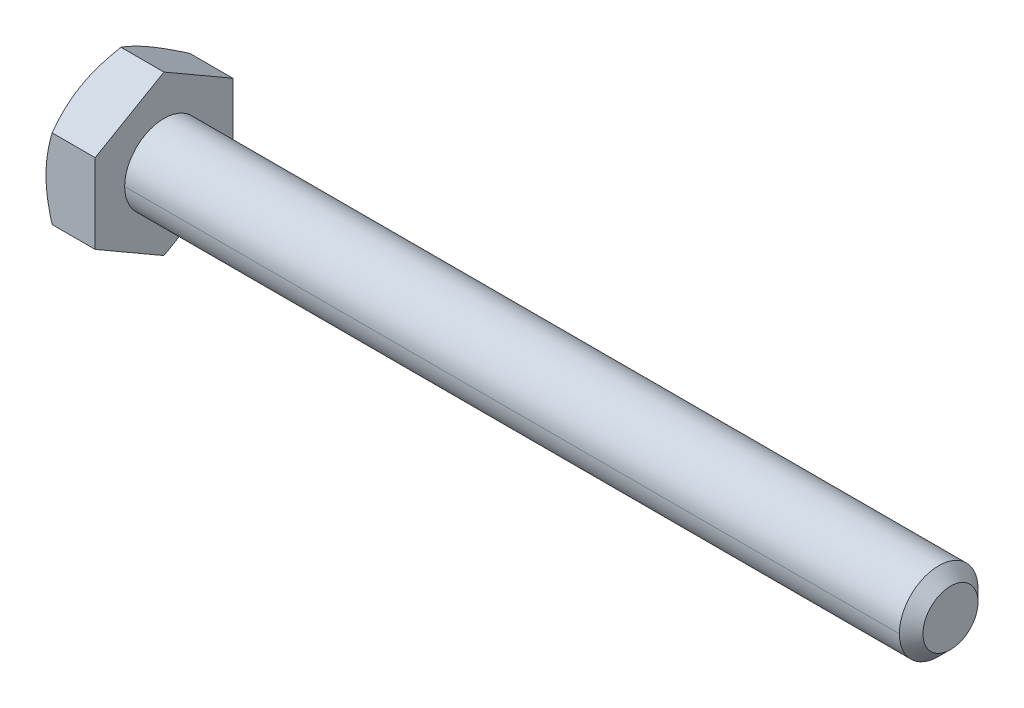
from build123d import *

# Parameters (mm, degrees)
SKETCH5_R           = 3.175
BOSS_EXTRUDE3_DEPTH = 63.5
CHAMFER1_SIZE       = 0.9525
BOSS_EXTRUDE4_DEPTH = 3.96875
SKETCH8_OUTSIDE_W   = 266.05
SKETCH8_OUTSIDE_H   = 267.77
SKETCH8_OUTSIDE_R   = 5.55625
CUT_EXTRUDE3_DEPTH  = 69.000490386
CUT_EXTRUDE3_DRAFT  = -60
CUT_EXTRUDE4_DEPTH  = 0.254
CIRPATTERN1_COUNT   = 3


with BuildPart() as part:
    # Sketch5 → Boss-Extrude3 (new body)
    with BuildSketch(Plane(origin=(33.734375, 0, 0), x_dir=(0, 0, -1), z_dir=(1, 0, 0))):
        Circle(SKETCH5_R)
    extrude(amount=-BOSS_EXTRUDE3_DEPTH)

    # Chamfer1
    chamfer1_edges = [part.edges().sort_by_distance(p)[0] for p in [
        (33.734375, 0, 3.175),
    ]]
    chamfer(chamfer1_edges, length=CHAMFER1_SIZE)

    # Sketch11 → Revolve1 (revolve)
    with BuildSketch(Plane.XY):
        Polygon((-29.765625, 3.175), (-29.765625, 0), (17.859375, 0), (14.684375, 3.175), align=None)
    revolve(axis=Axis((-29.765625, 0, 0), (1, 0, 0)))

    # Sketch6 → Boss-Extrude4 (add)
    with BuildSketch(Plane.ZY.offset(29.765625)):
        Polygon((5.55625, 3.207902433), (0, 6.415804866), (-5.55625, 3.207902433), (-5.55625, -3.207902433), (0, -6.415804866), (5.55625, -3.207902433), align=None)
    extrude(amount=BOSS_EXTRUDE4_DEPTH)


with BuildPart() as cut_extrude3_tool:
    # Sketch8 outside → Cut-Extrude3 (with draft: the straight prism first)
    with BuildSketch(Plane.ZY.offset(33.734375)):
        Rectangle(SKETCH8_OUTSIDE_W, SKETCH8_OUTSIDE_H)
        Circle(SKETCH8_OUTSIDE_R, mode=Mode.SUBTRACT)
    extrude(amount=-CUT_EXTRUDE3_DEPTH)
    # Cut-Extrude3: the draft: its side faces are tilted about the plane it starts from
    cut_extrude3_sides = [cut_extrude3_tool.faces().sort_by_distance(p)[0] for p in [
        (0.765870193, -133.885, 0),
        (0.765870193, 0, 133.025),
        (0.765870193, 133.885, 0),
        (0.765870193, 0, -133.025),
        (0.765870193, 0, -5.55625),
    ]]
    draft(cut_extrude3_sides, Plane.ZY.offset(33.734375), CUT_EXTRUDE3_DRAFT)


with BuildPart() as part_1:
    add(part.part)

    # Cut-Extrude3: cut by cut_extrude3_tool
    add(cut_extrude3_tool.part, mode=Mode.SUBTRACT)

    # Sketch12 → Cut-Extrude4 (cut)
    with BuildSketch(Plane.ZY.offset(33.734375)):
        with BuildLine():
            Line((0.1666875, 4.2783125), (0.1666875, 2.3891875))
            ThreePointArc((0.1666875, 2.3891875), (0, 2.2225), (-0.1666875, 2.3891875))
            Line((-0.1666875, 2.3891875), (-0.1666875, 4.2783125))
            ThreePointArc((-0.1666875, 4.2783125), (0, 4.445), (0.1666875, 4.2783125))
        make_face()
    cut_extrude4 = extrude(amount=-CUT_EXTRUDE4_DEPTH, mode=Mode.SUBTRACT)

    # CirPattern1: Cut-Extrude4 ×3 about axis
    cirpattern1_axis = Axis((0, 0, 0), (1, 0, 0))
    for i in range(1, CIRPATTERN1_COUNT):
        add(cut_extrude4.rotate(cirpattern1_axis, i * 360 / CIRPATTERN1_COUNT), mode=Mode.SUBTRACT)


solid = part_1.part
